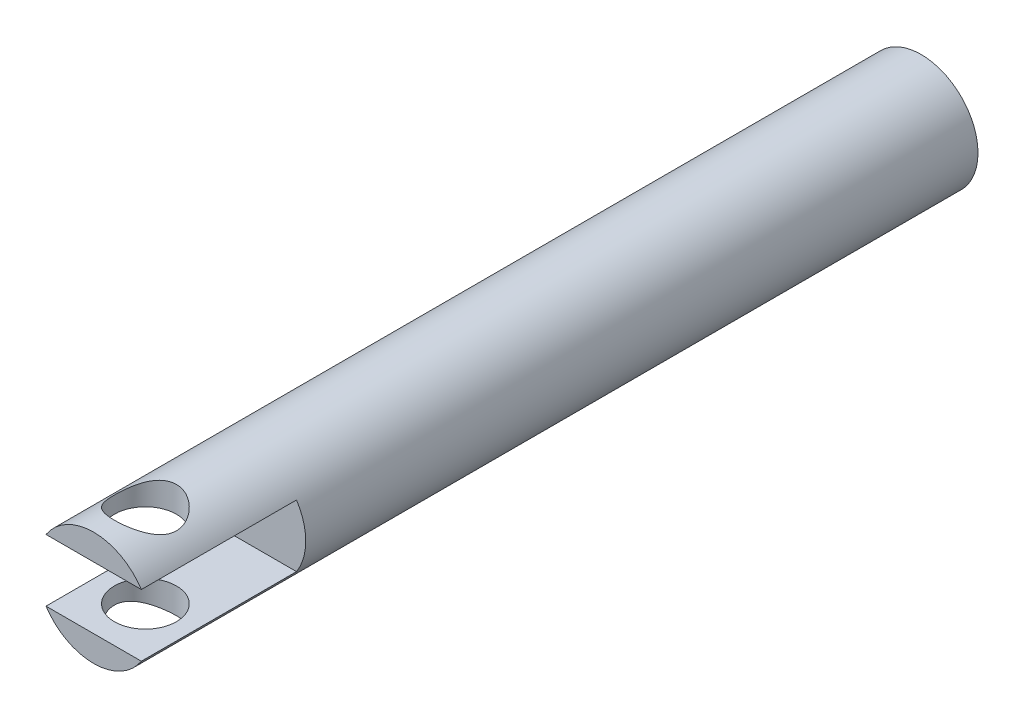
from build123d import *

# Parameters (mm, degrees)
ESQUISSE1_R                  = 11
EXTRUSION1_DEPTH             = 160
ENL_V_MAT_EXTRU_2_DEPTH      = 30
ENL_V_MAT_EXTRU_3_DEPTH      = 162.276160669
ENL_V_MAT_EXTRU_3_DEPTH_BACK = 162.276160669
ESQUISSE3_R                  = 6


with BuildPart() as part:
    # Esquisse1 → Extrusion1 (new body)
    with BuildSketch(Plane.XY):
        Circle(ESQUISSE1_R)
    extrude(amount=EXTRUSION1_DEPTH)

    # Esquisse2 → Enl_v. mat.-Extru.2 (cut)
    with BuildSketch(Plane.XY.offset(160)):
        Polygon((11, 0), (11, 6), (-11, 6), (-11, 0), (-11, -6), (11, -6), align=None)
    extrude(amount=-ENL_V_MAT_EXTRU_2_DEPTH, mode=Mode.SUBTRACT)

    # Esquisse3 → Enl_v. mat.-Extru.3 (cut, two sides: drawn at the far end of the back side and taken through both)
    with BuildSketch(Plane.XZ.offset(-6).offset(-ENL_V_MAT_EXTRU_3_DEPTH_BACK)):
        with Locations(Location((0, 150, 0), (0, 0, 270))):
            Circle(ESQUISSE3_R)
    extrude(amount=ENL_V_MAT_EXTRU_3_DEPTH + ENL_V_MAT_EXTRU_3_DEPTH_BACK, mode=Mode.SUBTRACT)


solid = part.part
